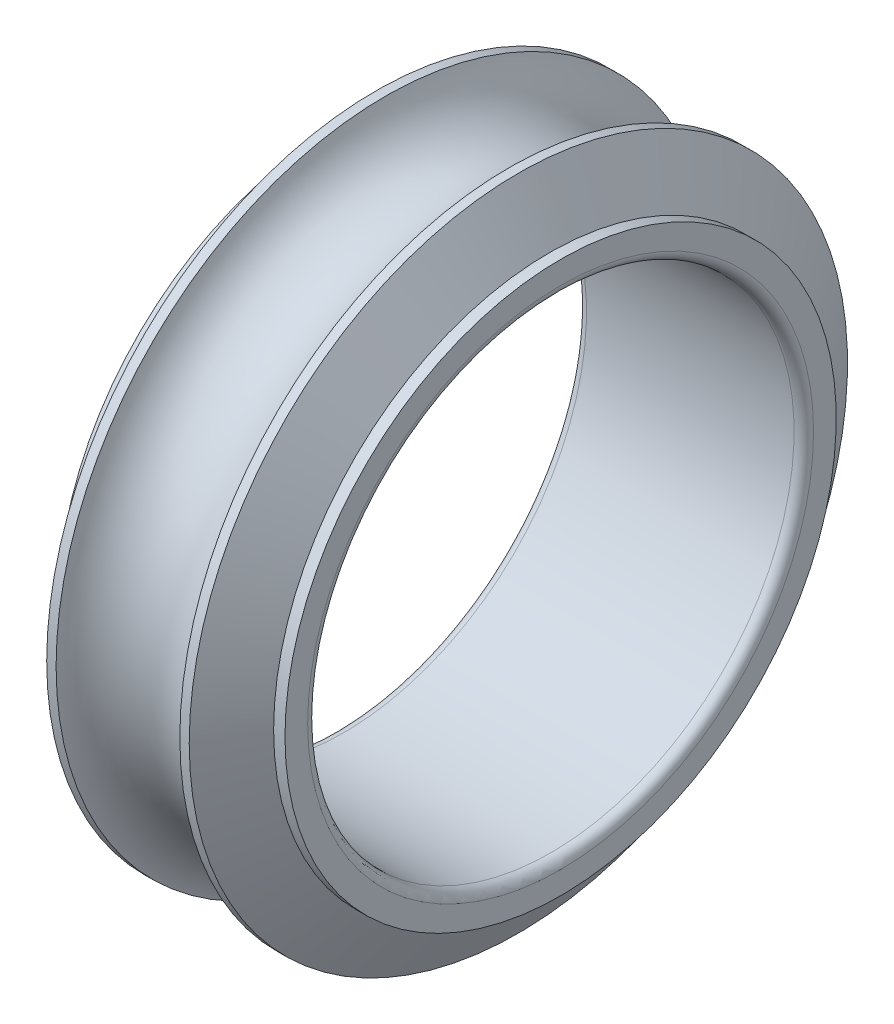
ISO-10303-21;
HEADER;
FILE_DESCRIPTION(('STEP AP214'),'2;1');
FILE_NAME('part.step','',(''),(''),'','','');
FILE_SCHEMA(('AUTOMOTIVE_DESIGN { 1 0 10303 214 1 1 1 1 }'));
ENDSEC;
DATA;
#1=APPLICATION_CONTEXT('core data for automotive mechanical design processes');
#2=APPLICATION_PROTOCOL_DEFINITION('international standard','automotive_design',2000,#1);
#3=PRODUCT_CONTEXT('',#1,'mechanical');
#4=PRODUCT('Part','Part','',(#3));
#5=PRODUCT_RELATED_PRODUCT_CATEGORY('part','',(#4));
#6=PRODUCT_DEFINITION_FORMATION('','',#4);
#7=PRODUCT_DEFINITION_CONTEXT('part definition',#1,'design');
#8=PRODUCT_DEFINITION('design','',#6,#7);
#9=PRODUCT_DEFINITION_SHAPE('','',#8);
#10=(LENGTH_UNIT() NAMED_UNIT(*) SI_UNIT(.MILLI.,.METRE.));
#11=(NAMED_UNIT(*) PLANE_ANGLE_UNIT() SI_UNIT($,.RADIAN.));
#12=(NAMED_UNIT(*) SI_UNIT($,.STERADIAN.) SOLID_ANGLE_UNIT());
#13=UNCERTAINTY_MEASURE_WITH_UNIT(LENGTH_MEASURE(1.E-05),#10,'distance_accuracy_value','');
#14=(GEOMETRIC_REPRESENTATION_CONTEXT(3) GLOBAL_UNCERTAINTY_ASSIGNED_CONTEXT((#13)) GLOBAL_UNIT_ASSIGNED_CONTEXT((#10,
#11,#12)) REPRESENTATION_CONTEXT('',''));
#15=CARTESIAN_POINT('',(0.,0.,0.));
#16=DIRECTION('',(0.,0.,1.));
#17=DIRECTION('',(1.,0.,0.));
#18=AXIS2_PLACEMENT_3D('',#15,#16,#17);
#19=CARTESIAN_POINT('',(6.7,0.,0.));
#20=DIRECTION('',(-1.,0.,0.));
#21=DIRECTION('',(0.,0.,1.));
#22=AXIS2_PLACEMENT_3D('',#19,#20,#21);
#23=TOROIDAL_SURFACE('',#22,7.8,0.3);
#24=CARTESIAN_POINT('',(7.,0.,0.));
#25=DIRECTION('',(-1.,0.,0.));
#26=DIRECTION('',(0.,0.,1.));
#27=AXIS2_PLACEMENT_3D('',#24,#25,#26);
#28=CIRCLE('',#27,7.8);
#29=CARTESIAN_POINT('',(7.,0.,7.8));
#30=VERTEX_POINT('',#29);
#31=EDGE_CURVE('E10',#30,#30,#28,.T.);
#32=ORIENTED_EDGE('',*,*,#31,.F.);
#33=EDGE_LOOP('',(#32));
#34=FACE_BOUND('',#33,.T.);
#35=CARTESIAN_POINT('',(6.7,0.,0.));
#36=DIRECTION('',(-1.,0.,0.));
#37=DIRECTION('',(0.,0.,1.));
#38=AXIS2_PLACEMENT_3D('',#35,#36,#37);
#39=CIRCLE('',#38,7.5);
#40=CARTESIAN_POINT('',(6.7,0.,7.5));
#41=VERTEX_POINT('',#40);
#42=EDGE_CURVE('E72',#41,#41,#39,.T.);
#43=ORIENTED_EDGE('',*,*,#42,.T.);
#44=EDGE_LOOP('',(#43));
#45=FACE_BOUND('',#44,.T.);
#46=ADVANCED_FACE('F14',(#34,#45),#23,.T.);
#47=CARTESIAN_POINT('',(7.,7.8,0.));
#48=DIRECTION('',(-1.,0.,0.));
#49=DIRECTION('',(0.,0.,1.));
#50=AXIS2_PLACEMENT_3D('',#47,#48,#49);
#51=PLANE('',#50);
#52=CARTESIAN_POINT('',(7.,0.,0.));
#53=DIRECTION('',(-1.,0.,0.));
#54=DIRECTION('',(0.,0.,1.));
#55=AXIS2_PLACEMENT_3D('',#52,#53,#54);
#56=CIRCLE('',#55,8.5);
#57=CARTESIAN_POINT('',(7.,0.,8.5));
#58=VERTEX_POINT('',#57);
#59=EDGE_CURVE('E21',#58,#58,#56,.T.);
#60=ORIENTED_EDGE('',*,*,#59,.F.);
#61=EDGE_LOOP('',(#60));
#62=FACE_BOUND('',#61,.T.);
#63=ORIENTED_EDGE('',*,*,#31,.T.);
#64=EDGE_LOOP('',(#63));
#65=FACE_BOUND('',#64,.T.);
#66=ADVANCED_FACE('F127',(#62,#65),#51,.F.);
#67=CARTESIAN_POINT('',(0.,0.,0.));
#68=DIRECTION('',(-1.,0.,0.));
#69=DIRECTION('',(0.,0.,1.));
#70=AXIS2_PLACEMENT_3D('',#67,#68,#69);
#71=CYLINDRICAL_SURFACE('',#70,8.5);
#72=CARTESIAN_POINT('',(6.65,0.,0.));
#73=DIRECTION('',(-1.,0.,0.));
#74=DIRECTION('',(0.,0.,1.));
#75=AXIS2_PLACEMENT_3D('',#72,#73,#74);
#76=CIRCLE('',#75,8.5);
#77=CARTESIAN_POINT('',(6.65,0.,8.5));
#78=VERTEX_POINT('',#77);
#79=EDGE_CURVE('E30',#78,#78,#76,.T.);
#80=ORIENTED_EDGE('',*,*,#79,.F.);
#81=EDGE_LOOP('',(#80));
#82=FACE_BOUND('',#81,.T.);
#83=ORIENTED_EDGE('',*,*,#59,.T.);
#84=EDGE_LOOP('',(#83));
#85=FACE_BOUND('',#84,.T.);
#86=ADVANCED_FACE('F132',(#82,#85),#71,.T.);
#87=CARTESIAN_POINT('',(6.65,0.,0.));
#88=DIRECTION('',(-1.,0.,0.));
#89=DIRECTION('',(0.,0.,1.));
#90=AXIS2_PLACEMENT_3D('',#87,#88,#89);
#91=CONICAL_SURFACE('',#90,8.5,1.0471975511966);
#92=CARTESIAN_POINT('',(5.69737205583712,0.,0.));
#93=DIRECTION('',(-1.,0.,0.));
#94=DIRECTION('',(0.,0.,1.));
#95=AXIS2_PLACEMENT_3D('',#92,#93,#94);
#96=CIRCLE('',#95,10.15);
#97=CARTESIAN_POINT('',(5.69737205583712,0.,10.15));
#98=VERTEX_POINT('',#97);
#99=EDGE_CURVE('E38',#98,#98,#96,.T.);
#100=ORIENTED_EDGE('',*,*,#99,.F.);
#101=EDGE_LOOP('',(#100));
#102=FACE_BOUND('',#101,.T.);
#103=ORIENTED_EDGE('',*,*,#79,.T.);
#104=EDGE_LOOP('',(#103));
#105=FACE_BOUND('',#104,.T.);
#106=ADVANCED_FACE('F123',(#102,#105),#91,.T.);
#107=CARTESIAN_POINT('',(0.,0.,0.));
#108=DIRECTION('',(-1.,0.,0.));
#109=DIRECTION('',(0.,0.,1.));
#110=AXIS2_PLACEMENT_3D('',#107,#108,#109);
#111=CYLINDRICAL_SURFACE('',#110,10.15);
#112=CARTESIAN_POINT('',(5.40787840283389,0.,0.));
#113=DIRECTION('',(-1.,0.,0.));
#114=DIRECTION('',(0.,0.,1.));
#115=AXIS2_PLACEMENT_3D('',#112,#113,#114);
#116=CIRCLE('',#115,10.15);
#117=CARTESIAN_POINT('',(5.40787840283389,0.,10.15));
#118=VERTEX_POINT('',#117);
#119=EDGE_CURVE('E44',#118,#118,#116,.T.);
#120=ORIENTED_EDGE('',*,*,#119,.F.);
#121=EDGE_LOOP('',(#120));
#122=FACE_BOUND('',#121,.T.);
#123=ORIENTED_EDGE('',*,*,#99,.T.);
#124=EDGE_LOOP('',(#123));
#125=FACE_BOUND('',#124,.T.);
#126=ADVANCED_FACE('F116',(#122,#125),#111,.T.);
#127=CARTESIAN_POINT('',(3.5,0.,0.));
#128=DIRECTION('',(-1.,0.,0.));
#129=DIRECTION('',(0.,0.,1.));
#130=AXIS2_PLACEMENT_3D('',#127,#128,#129);
#131=TOROIDAL_SURFACE('',#130,10.75,2.);
#132=ORIENTED_EDGE('',*,*,#119,.T.);
#133=EDGE_LOOP('',(#132));
#134=FACE_BOUND('',#133,.T.);
#135=CARTESIAN_POINT('',(1.59212159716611,0.,0.));
#136=DIRECTION('',(-1.,0.,0.));
#137=DIRECTION('',(0.,0.,1.));
#138=AXIS2_PLACEMENT_3D('',#135,#136,#137);
#139=CIRCLE('',#138,10.15);
#140=CARTESIAN_POINT('',(1.59212159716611,0.,10.15));
#141=VERTEX_POINT('',#140);
#142=EDGE_CURVE('E48',#141,#141,#139,.T.);
#143=ORIENTED_EDGE('',*,*,#142,.F.);
#144=EDGE_LOOP('',(#143));
#145=FACE_BOUND('',#144,.T.);
#146=ADVANCED_FACE('F111',(#134,#145),#131,.F.);
#147=CARTESIAN_POINT('',(0.,0.,0.));
#148=DIRECTION('',(-1.,0.,0.));
#149=DIRECTION('',(0.,0.,1.));
#150=AXIS2_PLACEMENT_3D('',#147,#148,#149);
#151=CYLINDRICAL_SURFACE('',#150,10.15);
#152=CARTESIAN_POINT('',(1.30262794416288,0.,0.));
#153=DIRECTION('',(-1.,0.,0.));
#154=DIRECTION('',(0.,0.,1.));
#155=AXIS2_PLACEMENT_3D('',#152,#153,#154);
#156=CIRCLE('',#155,10.15);
#157=CARTESIAN_POINT('',(1.30262794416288,0.,10.15));
#158=VERTEX_POINT('',#157);
#159=EDGE_CURVE('E52',#158,#158,#156,.T.);
#160=ORIENTED_EDGE('',*,*,#159,.F.);
#161=EDGE_LOOP('',(#160));
#162=FACE_BOUND('',#161,.T.);
#163=ORIENTED_EDGE('',*,*,#142,.T.);
#164=EDGE_LOOP('',(#163));
#165=FACE_BOUND('',#164,.T.);
#166=ADVANCED_FACE('F105',(#162,#165),#151,.T.);
#167=CARTESIAN_POINT('',(1.30262794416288,0.,0.));
#168=DIRECTION('',(1.,0.,0.));
#169=DIRECTION('',(0.,0.,-1.));
#170=AXIS2_PLACEMENT_3D('',#167,#168,#169);
#171=CONICAL_SURFACE('',#170,10.15,1.0471975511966);
#172=CARTESIAN_POINT('',(0.35,0.,0.));
#173=DIRECTION('',(-1.,0.,0.));
#174=DIRECTION('',(0.,0.,1.));
#175=AXIS2_PLACEMENT_3D('',#172,#173,#174);
#176=CIRCLE('',#175,8.5);
#177=CARTESIAN_POINT('',(0.35,0.,8.5));
#178=VERTEX_POINT('',#177);
#179=EDGE_CURVE('E56',#178,#178,#176,.T.);
#180=ORIENTED_EDGE('',*,*,#179,.F.);
#181=EDGE_LOOP('',(#180));
#182=FACE_BOUND('',#181,.T.);
#183=ORIENTED_EDGE('',*,*,#159,.T.);
#184=EDGE_LOOP('',(#183));
#185=FACE_BOUND('',#184,.T.);
#186=ADVANCED_FACE('F99',(#182,#185),#171,.T.);
#187=CARTESIAN_POINT('',(0.,0.,0.));
#188=DIRECTION('',(-1.,0.,0.));
#189=DIRECTION('',(0.,0.,1.));
#190=AXIS2_PLACEMENT_3D('',#187,#188,#189);
#191=CYLINDRICAL_SURFACE('',#190,8.5);
#192=CARTESIAN_POINT('',(0.,0.,0.));
#193=DIRECTION('',(-1.,0.,0.));
#194=DIRECTION('',(0.,0.,1.));
#195=AXIS2_PLACEMENT_3D('',#192,#193,#194);
#196=CIRCLE('',#195,8.5);
#197=CARTESIAN_POINT('',(0.,0.,8.5));
#198=VERTEX_POINT('',#197);
#199=EDGE_CURVE('E60',#198,#198,#196,.T.);
#200=ORIENTED_EDGE('',*,*,#199,.F.);
#201=EDGE_LOOP('',(#200));
#202=FACE_BOUND('',#201,.T.);
#203=ORIENTED_EDGE('',*,*,#179,.T.);
#204=EDGE_LOOP('',(#203));
#205=FACE_BOUND('',#204,.T.);
#206=ADVANCED_FACE('F93',(#202,#205),#191,.T.);
#207=CARTESIAN_POINT('',(0.,8.5,0.));
#208=DIRECTION('',(1.,0.,0.));
#209=DIRECTION('',(0.,0.,-1.));
#210=AXIS2_PLACEMENT_3D('',#207,#208,#209);
#211=PLANE('',#210);
#212=CARTESIAN_POINT('',(0.,0.,0.));
#213=DIRECTION('',(-1.,0.,0.));
#214=DIRECTION('',(0.,0.,1.));
#215=AXIS2_PLACEMENT_3D('',#212,#213,#214);
#216=CIRCLE('',#215,7.8);
#217=CARTESIAN_POINT('',(0.,0.,7.8));
#218=VERTEX_POINT('',#217);
#219=EDGE_CURVE('E64',#218,#218,#216,.T.);
#220=ORIENTED_EDGE('',*,*,#219,.F.);
#221=EDGE_LOOP('',(#220));
#222=FACE_BOUND('',#221,.T.);
#223=ORIENTED_EDGE('',*,*,#199,.T.);
#224=EDGE_LOOP('',(#223));
#225=FACE_BOUND('',#224,.T.);
#226=ADVANCED_FACE('F87',(#222,#225),#211,.F.);
#227=CARTESIAN_POINT('',(0.3,0.,0.));
#228=DIRECTION('',(-1.,0.,0.));
#229=DIRECTION('',(0.,0.,1.));
#230=AXIS2_PLACEMENT_3D('',#227,#228,#229);
#231=TOROIDAL_SURFACE('',#230,7.8,0.3);
#232=CARTESIAN_POINT('',(0.3,0.,0.));
#233=DIRECTION('',(-1.,0.,0.));
#234=DIRECTION('',(0.,0.,1.));
#235=AXIS2_PLACEMENT_3D('',#232,#233,#234);
#236=CIRCLE('',#235,7.5);
#237=CARTESIAN_POINT('',(0.3,0.,7.5));
#238=VERTEX_POINT('',#237);
#239=EDGE_CURVE('E68',#238,#238,#236,.T.);
#240=ORIENTED_EDGE('',*,*,#239,.F.);
#241=EDGE_LOOP('',(#240));
#242=FACE_BOUND('',#241,.T.);
#243=ORIENTED_EDGE('',*,*,#219,.T.);
#244=EDGE_LOOP('',(#243));
#245=FACE_BOUND('',#244,.T.);
#246=ADVANCED_FACE('F81',(#242,#245),#231,.T.);
#247=CARTESIAN_POINT('',(0.,0.,0.));
#248=DIRECTION('',(-1.,0.,0.));
#249=DIRECTION('',(0.,0.,1.));
#250=AXIS2_PLACEMENT_3D('',#247,#248,#249);
#251=CYLINDRICAL_SURFACE('',#250,7.5);
#252=ORIENTED_EDGE('',*,*,#42,.F.);
#253=EDGE_LOOP('',(#252));
#254=FACE_BOUND('',#253,.T.);
#255=ORIENTED_EDGE('',*,*,#239,.T.);
#256=EDGE_LOOP('',(#255));
#257=FACE_BOUND('',#256,.T.);
#258=ADVANCED_FACE('F78',(#254,#257),#251,.F.);
#259=CLOSED_SHELL('',(#46,#66,#86,#106,#126,#146,#166,#186,#206,#226,#246,#258));
#260=MANIFOLD_SOLID_BREP('B1',#259);
#261=ADVANCED_BREP_SHAPE_REPRESENTATION('',(#18,#260),#14);
#262=SHAPE_DEFINITION_REPRESENTATION(#9,#261);
ENDSEC;
END-ISO-10303-21;
